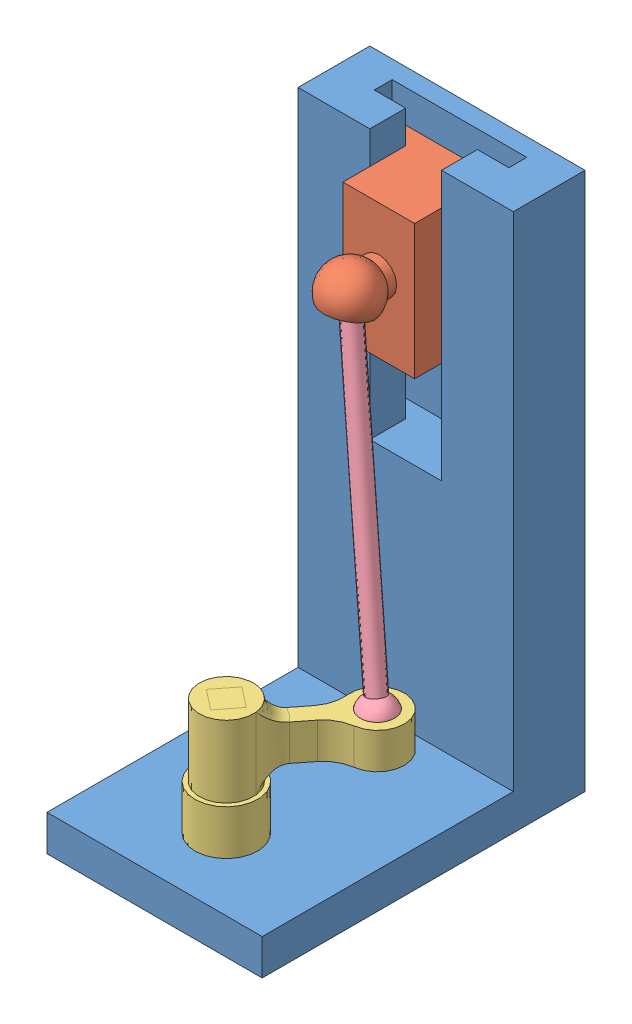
SolidWorks assembly 3D fourbar linkage.SLDASM, configuration Default (file format 11000). Lengths in mm.
Overall size (120.02 300 180).
4 component instances, 4 part files, 5 mates.
Components (placement in the parent):
- support-1: support.SLDPRT [Default] at (0 228 -71) x (0 1 0) z (1 0 0) size (300 180 120)
- SliderBlock-3: SliderBlock.SLDPRT [Default] at (0 209.8093 -71) x (-1 0 0) z (0 1 0) size (75 76 75)
- LeverArm-1: LeverArm.SLDPRT [Default] at (0 -72 69) x (0 1 0) z (0.616499 0 -0.787355) size (86.18 35 92.5)
- linkage-1: linkage.SLDPRT [Default] at (0.1309 146.2654 -125.3152) x (-0.2055 0.971163 -0.120882) z (0.978468 0.201461 -0.044866) size (200 20 20)
Mates (geometry in assembly coordinates):
- Hinge1: hinge: cylinder of assembly; plane of assembly; cylinder of assembly; plane of assembly; cylinder of LeverArm-1 through (0 -72 69) axis (0 -1 0) radius 12.5; cylinder of support-1 through (0 -72 69) axis (0 1 0) radius 12.5; plane of LeverArm-1 through (9.8419 -72 76.7062) normal (0 -1 0); plane of support-1 through (60 -72 109) normal (0 -1 0)
- Concentric1: concentric: sphere of assembly; sphere of assembly; sphere of LeverArm-1; sphere of linkage-1
- Concentric2: concentric: sphere of assembly; sphere of assembly; sphere of SliderBlock-3; sphere of linkage-1
- Coincident1: coincident: plane of assembly; plane of assembly; plane of SliderBlock-3 through (-37.5 134.8093 -61) normal (0 0 -1); plane of support-1 through (-37.5 78 -61) normal (0 0 1)
- Coincident2: coincident: plane of assembly; plane of assembly; plane of support-1 through (37.5 78 -61) normal (-1 0 0); plane of SliderBlock-3 through (37.5 134.8093 -61) normal (1 0 0)
